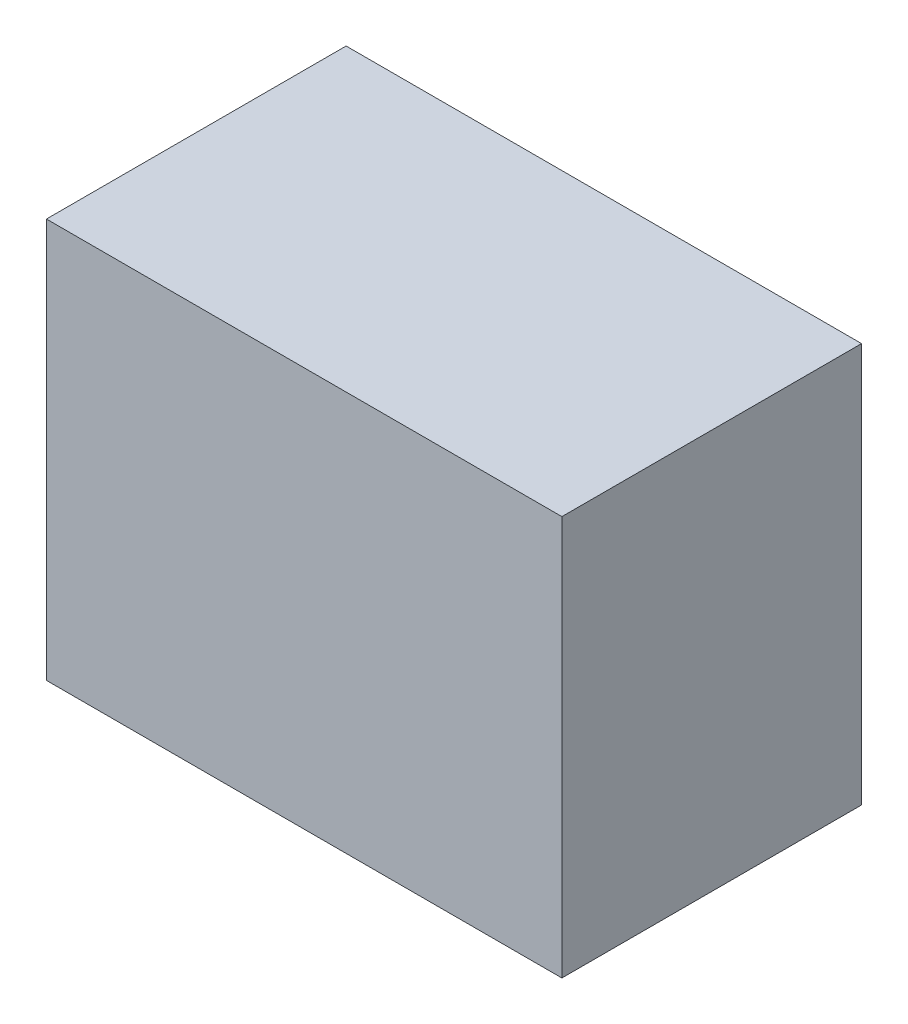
ISO-10303-21;
HEADER;
FILE_DESCRIPTION(('STEP AP214'),'2;1');
FILE_NAME('part.step','',(''),(''),'','','');
FILE_SCHEMA(('AUTOMOTIVE_DESIGN { 1 0 10303 214 1 1 1 1 }'));
ENDSEC;
DATA;
#1=APPLICATION_CONTEXT('core data for automotive mechanical design processes');
#2=APPLICATION_PROTOCOL_DEFINITION('international standard','automotive_design',2000,#1);
#3=PRODUCT_CONTEXT('',#1,'mechanical');
#4=PRODUCT('Part','Part','',(#3));
#5=PRODUCT_RELATED_PRODUCT_CATEGORY('part','',(#4));
#6=PRODUCT_DEFINITION_FORMATION('','',#4);
#7=PRODUCT_DEFINITION_CONTEXT('part definition',#1,'design');
#8=PRODUCT_DEFINITION('design','',#6,#7);
#9=PRODUCT_DEFINITION_SHAPE('','',#8);
#10=(LENGTH_UNIT() NAMED_UNIT(*) SI_UNIT(.MILLI.,.METRE.));
#11=(NAMED_UNIT(*) PLANE_ANGLE_UNIT() SI_UNIT($,.RADIAN.));
#12=(NAMED_UNIT(*) SI_UNIT($,.STERADIAN.) SOLID_ANGLE_UNIT());
#13=UNCERTAINTY_MEASURE_WITH_UNIT(LENGTH_MEASURE(1.E-05),#10,'distance_accuracy_value','');
#14=(GEOMETRIC_REPRESENTATION_CONTEXT(3) GLOBAL_UNCERTAINTY_ASSIGNED_CONTEXT((#13)) GLOBAL_UNIT_ASSIGNED_CONTEXT((#10,
#11,#12)) REPRESENTATION_CONTEXT('',''));
#15=CARTESIAN_POINT('',(0.,0.,0.));
#16=DIRECTION('',(0.,0.,1.));
#17=DIRECTION('',(1.,0.,0.));
#18=AXIS2_PLACEMENT_3D('',#15,#16,#17);
#19=CARTESIAN_POINT('',(0.,20.,0.));
#20=DIRECTION('',(1.,0.,0.));
#21=DIRECTION('',(0.,0.,-1.));
#22=AXIS2_PLACEMENT_3D('',#19,#20,#21);
#23=PLANE('',#22);
#24=DIRECTION('',(0.,0.,1.));
#25=VECTOR('',#24,1.);
#26=CARTESIAN_POINT('',(0.,0.,0.));
#27=LINE('',#26,#25);
#28=CARTESIAN_POINT('',(0.,0.,-15.));
#29=VERTEX_POINT('',#28);
#30=CARTESIAN_POINT('',(0.,0.,0.));
#31=VERTEX_POINT('',#30);
#32=EDGE_CURVE('E96',#29,#31,#27,.T.);
#33=ORIENTED_EDGE('',*,*,#32,.T.);
#34=DIRECTION('',(0.,-1.,0.));
#35=VECTOR('',#34,1.);
#36=CARTESIAN_POINT('',(0.,20.,0.));
#37=LINE('',#36,#35);
#38=CARTESIAN_POINT('',(0.,20.,0.));
#39=VERTEX_POINT('',#38);
#40=EDGE_CURVE('E11',#39,#31,#37,.T.);
#41=ORIENTED_EDGE('',*,*,#40,.F.);
#42=DIRECTION('',(0.,0.,1.));
#43=VECTOR('',#42,1.);
#44=CARTESIAN_POINT('',(0.,20.,0.));
#45=LINE('',#44,#43);
#46=CARTESIAN_POINT('',(0.,20.,-15.));
#47=VERTEX_POINT('',#46);
#48=EDGE_CURVE('E84',#47,#39,#45,.T.);
#49=ORIENTED_EDGE('',*,*,#48,.F.);
#50=DIRECTION('',(0.,-1.,0.));
#51=VECTOR('',#50,1.);
#52=CARTESIAN_POINT('',(0.,20.,-15.));
#53=LINE('',#52,#51);
#54=EDGE_CURVE('E92',#47,#29,#53,.T.);
#55=ORIENTED_EDGE('',*,*,#54,.T.);
#56=EDGE_LOOP('',(#33,#41,#49,#55));
#57=FACE_BOUND('',#56,.T.);
#58=ADVANCED_FACE('F33',(#57),#23,.F.);
#59=CARTESIAN_POINT('',(0.,20.,0.));
#60=DIRECTION('',(0.,0.,-1.));
#61=DIRECTION('',(-1.,0.,0.));
#62=AXIS2_PLACEMENT_3D('',#59,#60,#61);
#63=PLANE('',#62);
#64=DIRECTION('',(1.,0.,0.));
#65=VECTOR('',#64,1.);
#66=CARTESIAN_POINT('',(0.,0.,0.));
#67=LINE('',#66,#65);
#68=CARTESIAN_POINT('',(25.8,0.,0.));
#69=VERTEX_POINT('',#68);
#70=EDGE_CURVE('E88',#31,#69,#67,.T.);
#71=ORIENTED_EDGE('',*,*,#70,.T.);
#72=DIRECTION('',(0.,-1.,0.));
#73=VECTOR('',#72,1.);
#74=CARTESIAN_POINT('',(25.8,20.,0.));
#75=LINE('',#74,#73);
#76=CARTESIAN_POINT('',(25.8,20.,0.));
#77=VERTEX_POINT('',#76);
#78=EDGE_CURVE('E41',#77,#69,#75,.T.);
#79=ORIENTED_EDGE('',*,*,#78,.F.);
#80=DIRECTION('',(1.,0.,0.));
#81=VECTOR('',#80,1.);
#82=CARTESIAN_POINT('',(0.,20.,0.));
#83=LINE('',#82,#81);
#84=EDGE_CURVE('E79',#39,#77,#83,.T.);
#85=ORIENTED_EDGE('',*,*,#84,.F.);
#86=ORIENTED_EDGE('',*,*,#40,.T.);
#87=EDGE_LOOP('',(#71,#79,#85,#86));
#88=FACE_BOUND('',#87,.T.);
#89=ADVANCED_FACE('F87',(#88),#63,.F.);
#90=CARTESIAN_POINT('',(25.8,20.,0.));
#91=DIRECTION('',(-1.,0.,0.));
#92=DIRECTION('',(0.,0.,1.));
#93=AXIS2_PLACEMENT_3D('',#90,#91,#92);
#94=PLANE('',#93);
#95=DIRECTION('',(0.,0.,-1.));
#96=VECTOR('',#95,1.);
#97=CARTESIAN_POINT('',(25.8,0.,0.));
#98=LINE('',#97,#96);
#99=CARTESIAN_POINT('',(25.8,0.,-15.));
#100=VERTEX_POINT('',#99);
#101=EDGE_CURVE('E66',#69,#100,#98,.T.);
#102=ORIENTED_EDGE('',*,*,#101,.T.);
#103=DIRECTION('',(0.,-1.,0.));
#104=VECTOR('',#103,1.);
#105=CARTESIAN_POINT('',(25.8,20.,-15.));
#106=LINE('',#105,#104);
#107=CARTESIAN_POINT('',(25.8,20.,-15.));
#108=VERTEX_POINT('',#107);
#109=EDGE_CURVE('E89',#108,#100,#106,.T.);
#110=ORIENTED_EDGE('',*,*,#109,.F.);
#111=DIRECTION('',(0.,0.,-1.));
#112=VECTOR('',#111,1.);
#113=CARTESIAN_POINT('',(25.8,20.,0.));
#114=LINE('',#113,#112);
#115=EDGE_CURVE('E82',#77,#108,#114,.T.);
#116=ORIENTED_EDGE('',*,*,#115,.F.);
#117=ORIENTED_EDGE('',*,*,#78,.T.);
#118=EDGE_LOOP('',(#102,#110,#116,#117));
#119=FACE_BOUND('',#118,.T.);
#120=ADVANCED_FACE('F90',(#119),#94,.F.);
#121=CARTESIAN_POINT('',(0.,20.,-15.));
#122=DIRECTION('',(0.,0.,1.));
#123=DIRECTION('',(1.,0.,0.));
#124=AXIS2_PLACEMENT_3D('',#121,#122,#123);
#125=PLANE('',#124);
#126=DIRECTION('',(-1.,0.,0.));
#127=VECTOR('',#126,1.);
#128=CARTESIAN_POINT('',(0.,0.,-15.));
#129=LINE('',#128,#127);
#130=EDGE_CURVE('E72',#100,#29,#129,.T.);
#131=ORIENTED_EDGE('',*,*,#130,.T.);
#132=ORIENTED_EDGE('',*,*,#54,.F.);
#133=DIRECTION('',(-1.,0.,0.));
#134=VECTOR('',#133,1.);
#135=CARTESIAN_POINT('',(0.,20.,-15.));
#136=LINE('',#135,#134);
#137=EDGE_CURVE('E49',#108,#47,#136,.T.);
#138=ORIENTED_EDGE('',*,*,#137,.F.);
#139=ORIENTED_EDGE('',*,*,#109,.T.);
#140=EDGE_LOOP('',(#131,#132,#138,#139));
#141=FACE_BOUND('',#140,.T.);
#142=ADVANCED_FACE('F103',(#141),#125,.F.);
#143=CARTESIAN_POINT('',(0.,20.,0.));
#144=DIRECTION('',(0.,-1.,0.));
#145=DIRECTION('',(0.,0.,-1.));
#146=AXIS2_PLACEMENT_3D('',#143,#144,#145);
#147=PLANE('',#146);
#148=ORIENTED_EDGE('',*,*,#48,.T.);
#149=ORIENTED_EDGE('',*,*,#84,.T.);
#150=ORIENTED_EDGE('',*,*,#115,.T.);
#151=ORIENTED_EDGE('',*,*,#137,.T.);
#152=EDGE_LOOP('',(#148,#149,#150,#151));
#153=FACE_BOUND('',#152,.T.);
#154=ADVANCED_FACE('F80',(#153),#147,.F.);
#155=CARTESIAN_POINT('',(0.,0.,0.));
#156=DIRECTION('',(0.,-1.,0.));
#157=DIRECTION('',(0.,0.,-1.));
#158=AXIS2_PLACEMENT_3D('',#155,#156,#157);
#159=PLANE('',#158);
#160=ORIENTED_EDGE('',*,*,#32,.F.);
#161=ORIENTED_EDGE('',*,*,#130,.F.);
#162=ORIENTED_EDGE('',*,*,#101,.F.);
#163=ORIENTED_EDGE('',*,*,#70,.F.);
#164=EDGE_LOOP('',(#160,#161,#162,#163));
#165=FACE_BOUND('',#164,.T.);
#166=ADVANCED_FACE('F106',(#165),#159,.T.);
#167=CLOSED_SHELL('',(#58,#89,#120,#142,#154,#166));
#168=MANIFOLD_SOLID_BREP('B2',#167);
#169=ADVANCED_BREP_SHAPE_REPRESENTATION('',(#18,#168),#14);
#170=SHAPE_DEFINITION_REPRESENTATION(#9,#169);
ENDSEC;
END-ISO-10303-21;
